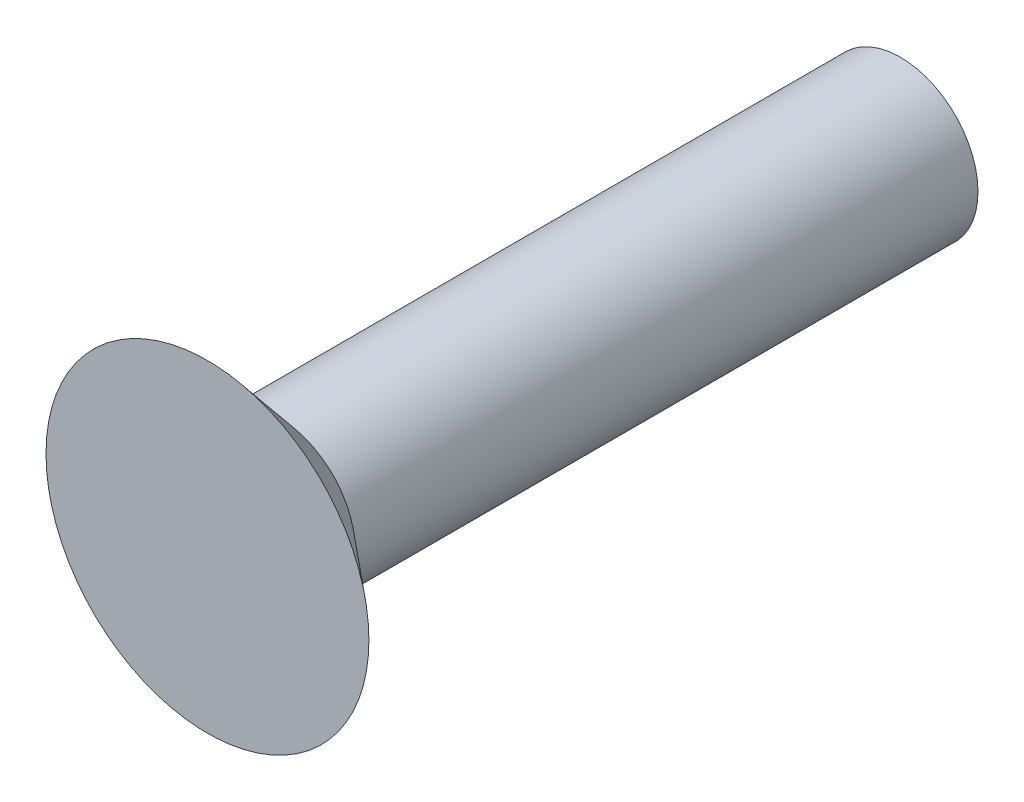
from build123d import *

# Parameters (mm, degrees)
SKETCH1_R           = 0.7112
BOSS_EXTRUDE1_DEPTH = 6.35


with BuildPart() as part:
    # Sketch1 → Boss-Extrude1 (new body)
    with BuildSketch(Plane.XY):
        Circle(SKETCH1_R)
    extrude(amount=-BOSS_EXTRUDE1_DEPTH)

    # Sketch2 → Revolve1 (revolve)
    with BuildSketch(Plane(origin=(0, 0, 0), x_dir=(1, 0, 0), z_dir=(0, 1, 0)), mode=Mode.PRIVATE) as revolve1_sk:
        Polygon((0, 0), (-1.47955, 0), (0, 1.241489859), align=None)
    revolve(revolve1_sk.sketch.rotate(Axis((0, 0, -1.241489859), (0, 0, 1)), 180), axis=Axis((0, 0, -1.241489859), (0, 0, 1)))


solid = part.part
